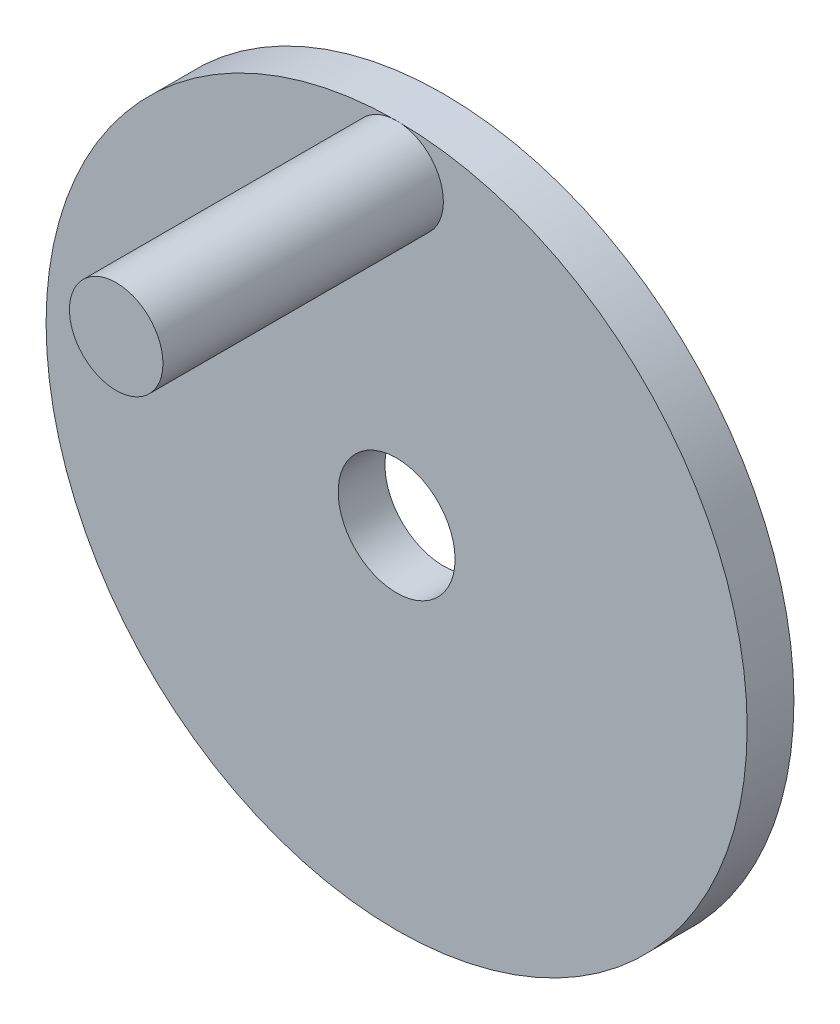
ISO-10303-21;
HEADER;
FILE_DESCRIPTION(('STEP AP214'),'2;1');
FILE_NAME('part.step','',(''),(''),'','','');
FILE_SCHEMA(('AUTOMOTIVE_DESIGN { 1 0 10303 214 1 1 1 1 }'));
ENDSEC;
DATA;
#1=APPLICATION_CONTEXT('core data for automotive mechanical design processes');
#2=APPLICATION_PROTOCOL_DEFINITION('international standard','automotive_design',2000,#1);
#3=PRODUCT_CONTEXT('',#1,'mechanical');
#4=PRODUCT('Part','Part','',(#3));
#5=PRODUCT_RELATED_PRODUCT_CATEGORY('part','',(#4));
#6=PRODUCT_DEFINITION_FORMATION('','',#4);
#7=PRODUCT_DEFINITION_CONTEXT('part definition',#1,'design');
#8=PRODUCT_DEFINITION('design','',#6,#7);
#9=PRODUCT_DEFINITION_SHAPE('','',#8);
#10=(LENGTH_UNIT() NAMED_UNIT(*) SI_UNIT(.MILLI.,.METRE.));
#11=(NAMED_UNIT(*) PLANE_ANGLE_UNIT() SI_UNIT($,.RADIAN.));
#12=(NAMED_UNIT(*) SI_UNIT($,.STERADIAN.) SOLID_ANGLE_UNIT());
#13=UNCERTAINTY_MEASURE_WITH_UNIT(LENGTH_MEASURE(1.E-05),#10,'distance_accuracy_value','');
#14=(GEOMETRIC_REPRESENTATION_CONTEXT(3) GLOBAL_UNCERTAINTY_ASSIGNED_CONTEXT((#13)) GLOBAL_UNIT_ASSIGNED_CONTEXT((#10,
#11,#12)) REPRESENTATION_CONTEXT('',''));
#15=CARTESIAN_POINT('',(0.,0.,0.));
#16=DIRECTION('',(0.,0.,1.));
#17=DIRECTION('',(1.,0.,0.));
#18=AXIS2_PLACEMENT_3D('',#15,#16,#17);
#19=CARTESIAN_POINT('',(0.,0.,2.54));
#20=DIRECTION('',(0.,0.,-1.));
#21=DIRECTION('',(-1.,0.,0.));
#22=AXIS2_PLACEMENT_3D('',#19,#20,#21);
#23=CYLINDRICAL_SURFACE('',#22,19.05);
#24=CARTESIAN_POINT('',(0.,0.,2.54));
#25=DIRECTION('',(0.,0.,1.));
#26=DIRECTION('',(1.,0.,0.));
#27=AXIS2_PLACEMENT_3D('',#24,#25,#26);
#28=CIRCLE('',#27,19.05);
#29=CARTESIAN_POINT('',(0.,19.05,2.54));
#30=VERTEX_POINT('',#29);
#31=EDGE_CURVE('E11',#30,#30,#28,.T.);
#32=ORIENTED_EDGE('',*,*,#31,.F.);
#33=EDGE_LOOP('',(#32));
#34=FACE_BOUND('',#33,.T.);
#35=CARTESIAN_POINT('',(0.,0.,0.));
#36=DIRECTION('',(0.,0.,1.));
#37=DIRECTION('',(1.,0.,0.));
#38=AXIS2_PLACEMENT_3D('',#35,#36,#37);
#39=CIRCLE('',#38,19.05);
#40=CARTESIAN_POINT('',(19.05,0.,0.));
#41=VERTEX_POINT('',#40);
#42=EDGE_CURVE('E46',#41,#41,#39,.T.);
#43=ORIENTED_EDGE('',*,*,#42,.T.);
#44=EDGE_LOOP('',(#43));
#45=FACE_BOUND('',#44,.T.);
#46=ADVANCED_FACE('F43',(#34,#45),#23,.T.);
#47=CARTESIAN_POINT('',(0.,0.,2.54));
#48=DIRECTION('',(0.,0.,1.));
#49=DIRECTION('',(1.,0.,0.));
#50=AXIS2_PLACEMENT_3D('',#47,#48,#49);
#51=PLANE('',#50);
#52=CARTESIAN_POINT('',(0.,0.,2.54));
#53=DIRECTION('',(0.,0.,1.));
#54=DIRECTION('',(1.,0.,0.));
#55=AXIS2_PLACEMENT_3D('',#52,#53,#54);
#56=CIRCLE('',#55,3.175);
#57=CARTESIAN_POINT('',(3.175,0.,2.54));
#58=VERTEX_POINT('',#57);
#59=EDGE_CURVE('E70',#58,#58,#56,.T.);
#60=ORIENTED_EDGE('',*,*,#59,.F.);
#61=EDGE_LOOP('',(#60));
#62=FACE_BOUND('',#61,.T.);
#63=ORIENTED_EDGE('',*,*,#31,.T.);
#64=CARTESIAN_POINT('',(0.,16.51,2.54));
#65=DIRECTION('',(0.,0.,1.));
#66=DIRECTION('',(1.,0.,0.));
#67=AXIS2_PLACEMENT_3D('',#64,#65,#66);
#68=CIRCLE('',#67,2.54);
#69=EDGE_CURVE('E58',#30,#30,#68,.T.);
#70=ORIENTED_EDGE('',*,*,#69,.F.);
#71=EDGE_LOOP('',(#63,#70));
#72=FACE_BOUND('',#71,.T.);
#73=ADVANCED_FACE('F56',(#62,#72),#51,.T.);
#74=CARTESIAN_POINT('',(0.,0.,0.));
#75=DIRECTION('',(0.,0.,1.));
#76=DIRECTION('',(1.,0.,0.));
#77=AXIS2_PLACEMENT_3D('',#74,#75,#76);
#78=PLANE('',#77);
#79=CARTESIAN_POINT('',(0.,0.,0.));
#80=DIRECTION('',(0.,0.,1.));
#81=DIRECTION('',(1.,0.,0.));
#82=AXIS2_PLACEMENT_3D('',#79,#80,#81);
#83=CIRCLE('',#82,3.175);
#84=CARTESIAN_POINT('',(3.175,0.,0.));
#85=VERTEX_POINT('',#84);
#86=EDGE_CURVE('E62',#85,#85,#83,.T.);
#87=ORIENTED_EDGE('',*,*,#86,.T.);
#88=EDGE_LOOP('',(#87));
#89=FACE_BOUND('',#88,.T.);
#90=ORIENTED_EDGE('',*,*,#42,.F.);
#91=EDGE_LOOP('',(#90));
#92=FACE_BOUND('',#91,.T.);
#93=ADVANCED_FACE('F81',(#89,#92),#78,.F.);
#94=CARTESIAN_POINT('',(0.,16.51,17.78));
#95=DIRECTION('',(0.,0.,-1.));
#96=DIRECTION('',(-1.,0.,0.));
#97=AXIS2_PLACEMENT_3D('',#94,#95,#96);
#98=CYLINDRICAL_SURFACE('',#97,2.54);
#99=CARTESIAN_POINT('',(0.,16.51,17.78));
#100=DIRECTION('',(0.,0.,1.));
#101=DIRECTION('',(1.,0.,0.));
#102=AXIS2_PLACEMENT_3D('',#99,#100,#101);
#103=CIRCLE('',#102,2.54);
#104=CARTESIAN_POINT('',(2.54,16.51,17.78));
#105=VERTEX_POINT('',#104);
#106=EDGE_CURVE('E61',#105,#105,#103,.T.);
#107=ORIENTED_EDGE('',*,*,#106,.F.);
#108=EDGE_LOOP('',(#107));
#109=FACE_BOUND('',#108,.T.);
#110=ORIENTED_EDGE('',*,*,#69,.T.);
#111=EDGE_LOOP('',(#110));
#112=FACE_BOUND('',#111,.T.);
#113=ADVANCED_FACE('F87',(#109,#112),#98,.T.);
#114=CARTESIAN_POINT('',(0.,16.51,17.78));
#115=DIRECTION('',(0.,0.,1.));
#116=DIRECTION('',(1.,0.,0.));
#117=AXIS2_PLACEMENT_3D('',#114,#115,#116);
#118=PLANE('',#117);
#119=ORIENTED_EDGE('',*,*,#106,.T.);
#120=EDGE_LOOP('',(#119));
#121=FACE_BOUND('',#120,.T.);
#122=ADVANCED_FACE('F93',(#121),#118,.T.);
#123=CARTESIAN_POINT('',(0.,0.,0.));
#124=DIRECTION('',(0.,0.,1.));
#125=DIRECTION('',(1.,0.,0.));
#126=AXIS2_PLACEMENT_3D('',#123,#124,#125);
#127=CYLINDRICAL_SURFACE('',#126,3.175);
#128=ORIENTED_EDGE('',*,*,#86,.F.);
#129=EDGE_LOOP('',(#128));
#130=FACE_BOUND('',#129,.T.);
#131=ORIENTED_EDGE('',*,*,#59,.T.);
#132=EDGE_LOOP('',(#131));
#133=FACE_BOUND('',#132,.T.);
#134=ADVANCED_FACE('F78',(#130,#133),#127,.F.);
#135=CLOSED_SHELL('',(#46,#73,#93,#113,#122,#134));
#136=MANIFOLD_SOLID_BREP('B2',#135);
#137=ADVANCED_BREP_SHAPE_REPRESENTATION('',(#18,#136),#14);
#138=SHAPE_DEFINITION_REPRESENTATION(#9,#137);
ENDSEC;
END-ISO-10303-21;
